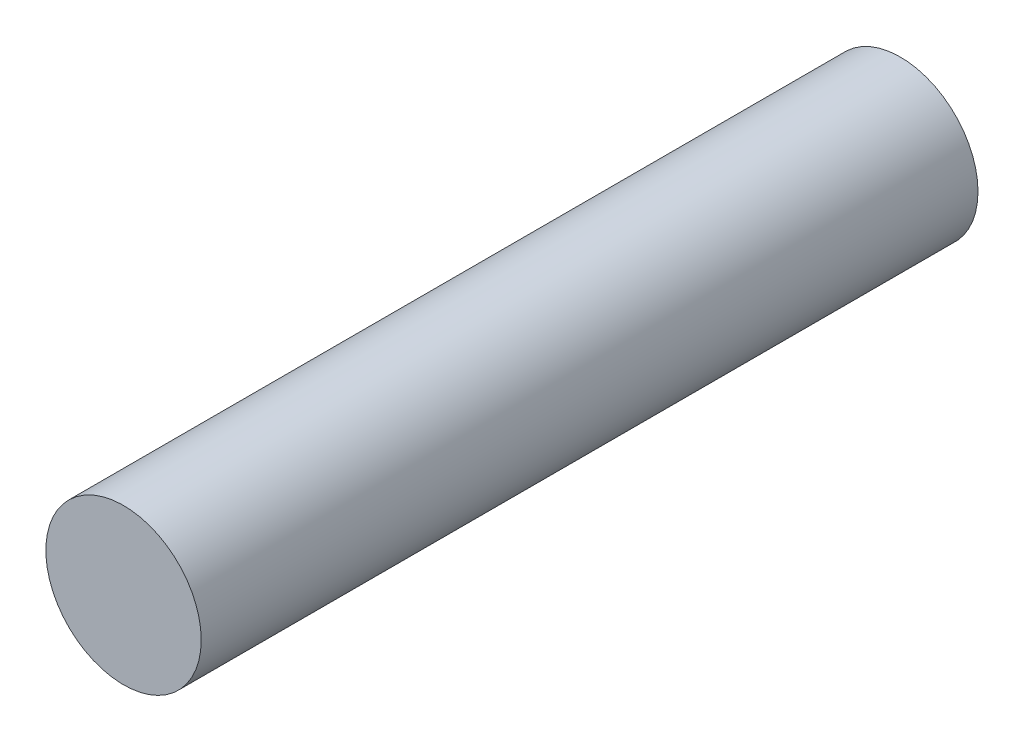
from build123d import *

# Parameters (mm, degrees)
SKETCH1_R           = 2.5
BOSS_EXTRUDE1_DEPTH = 25


with BuildPart() as part:
    # Sketch1 → Boss-Extrude1 (new body)
    with BuildSketch(Plane.XY):
        Circle(SKETCH1_R)
    extrude(amount=BOSS_EXTRUDE1_DEPTH)


solid = part.part
